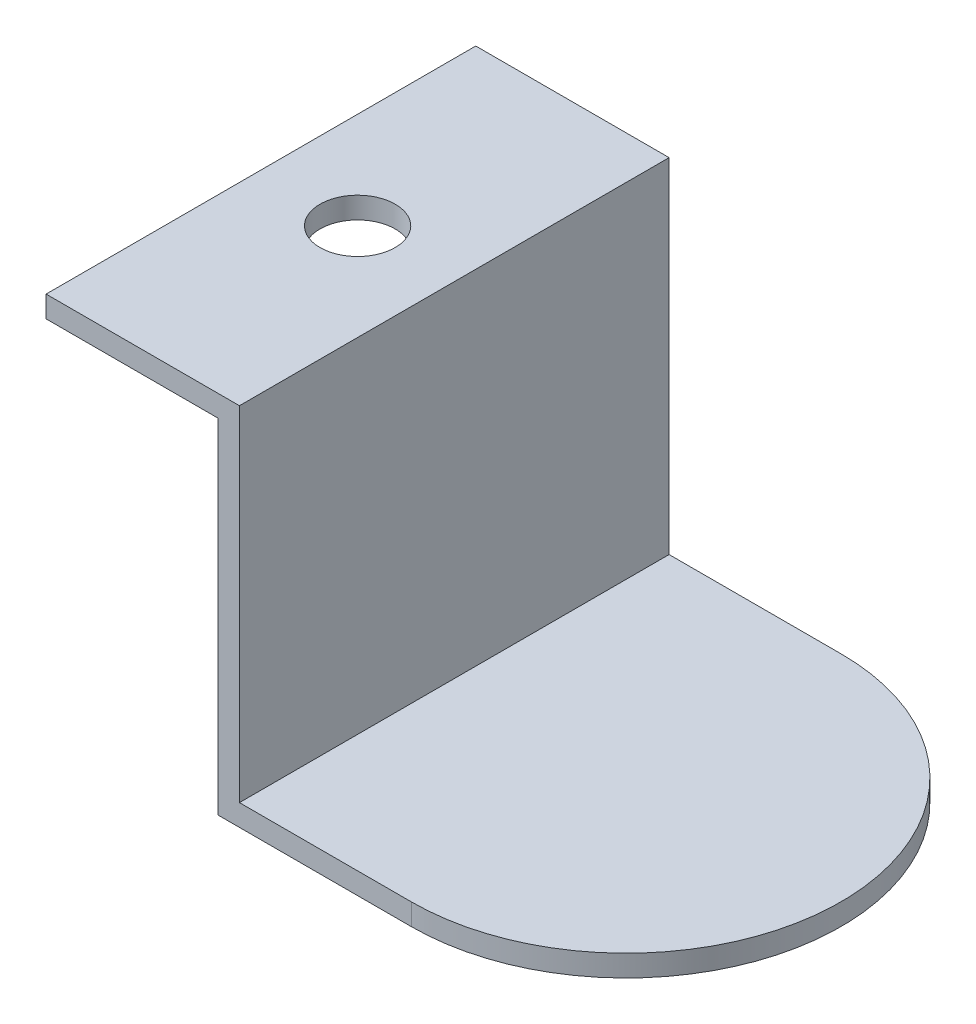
from build123d import *

# Parameters (mm, degrees)
EXTRUDE1_DEPTH     = 20
SKETCH2_R          = 1.75
CUT_EXTRUDE1_DEPTH = 20
CUT_EXTRUDE2_DEPTH = 20


with BuildPart() as part:
    # Sketch1 → Extrude1 (new body)
    with BuildSketch(Plane.XY):
        Polygon((0, 0), (9, 0), (9, -16), (27, -16), (27, -17), (8, -17), (8, -1), (0, -1), align=None)
    extrude(amount=EXTRUDE1_DEPTH)

    # Sketch2 → Cut-Extrude1 (cut)
    with BuildSketch(Plane(origin=(0, 0, 0), x_dir=(-1, 0, 0), z_dir=(0, 1, 0))):
        with Locations(Location((-4.5, 10, 0), (0, 0, 90))):
            Circle(SKETCH2_R)
    extrude(amount=-CUT_EXTRUDE1_DEPTH, mode=Mode.SUBTRACT)

    # Sketch3 → Cut-Extrude2 (cut)
    with BuildSketch(Plane(origin=(0, -16, 0), x_dir=(-1, 0, 0), z_dir=(0, 1, 0))):
        with BuildLine():
            Line((-17, 0), (-31.79224748, 0))
            Line((-31.79224748, 0), (-31.79224748, 20))
            Line((-31.79224748, 20), (-17, 20))
            ThreePointArc((-17, 20), (-27, 10), (-17, 0))
        make_face()
    extrude(amount=-CUT_EXTRUDE2_DEPTH, mode=Mode.SUBTRACT)


solid = part.part
